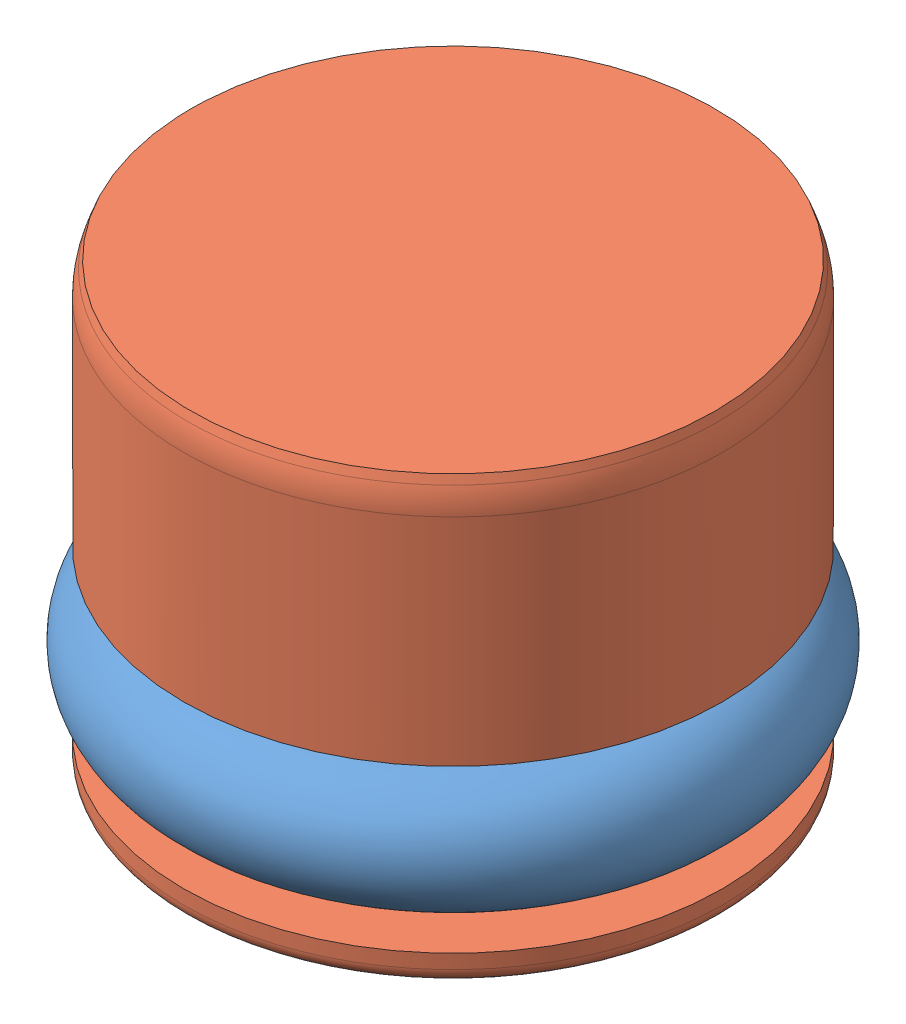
SolidWorks assembly A0_plunger.SLDASM, configuration Default (file format 12000). Lengths in mm.
Overall size (8.55 8 8.55).
2 component instances, 2 part files, 3 mates.
Components (placement in the parent):
- comp_o-ring-008-1: comp_o-ring-008.SLDPRT [Default] at (-1.6837 -2.9375 -8.5282) x (0.99772 0 0.067488) z (-0.067488 0 0.99772) size (8.03 1.78 8.03)
- A0_plunger-1: A0_plunger.SLDPRT [4.6] at (-1.6837 1.6625 -8.5282) size (7.52 8 7.52)
Mates (geometry in assembly coordinates):
- Coincident1: coincident anti-aligned: line of A0_plunger-1 through (-1.6837 -1.8075 -8.5282) axis (0 1 0); line of ? through (0 -2.3021 0) axis (0 -1 0)
- Symmetric1: symmetric aligned: plane of LnG5_plunger-1 through (0.6163 -1.8075 -8.5282) normal (0 -1 0); plane of LnG5_plunger-1 through (2.0763 -4.0675 -8.5282) normal (0 1 0); plane of comp_o-ring-008-1 through (0 -4.6 0) normal (0 1 0)
- Coincident2: coincident: line of assembly; axis of comp_o-ring-008-1 through (-1.6837 -0.6396 -8.5282) axis (0 -1 0); axis of A0_plunger-1 through (-1.6837 -4.0675 -8.5282) axis (0 1 0)
